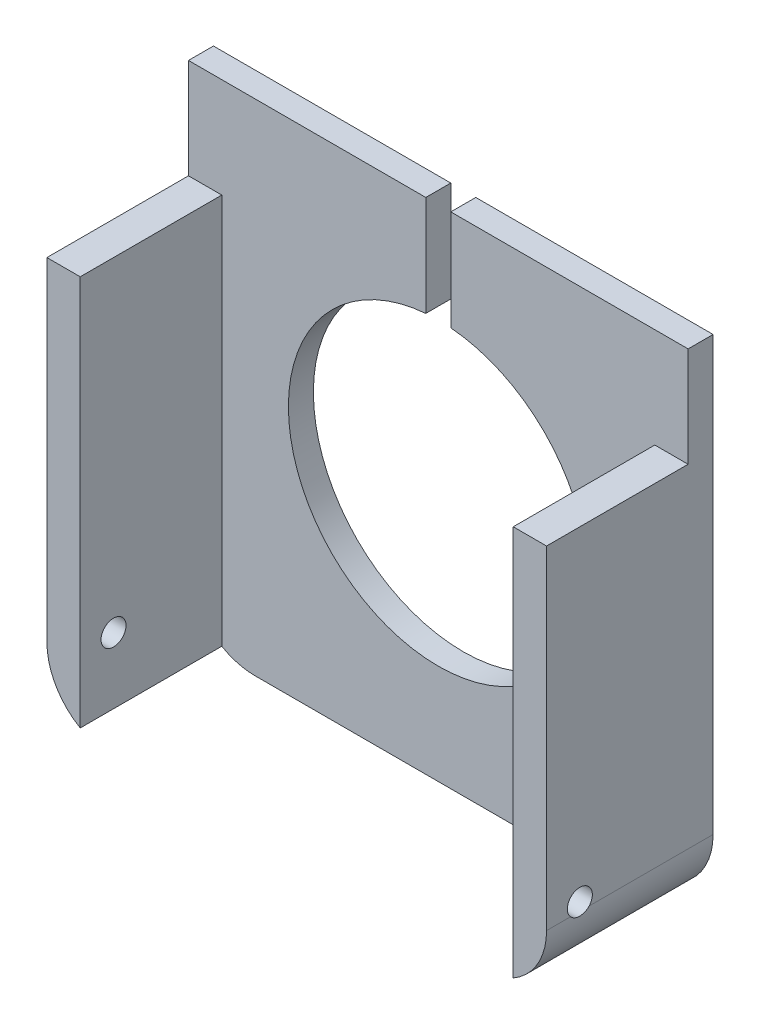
ISO-10303-21;
HEADER;
FILE_DESCRIPTION(('STEP AP214'),'2;1');
FILE_NAME('part.step','',(''),(''),'','','');
FILE_SCHEMA(('AUTOMOTIVE_DESIGN { 1 0 10303 214 1 1 1 1 }'));
ENDSEC;
DATA;
#1=APPLICATION_CONTEXT('core data for automotive mechanical design processes');
#2=APPLICATION_PROTOCOL_DEFINITION('international standard','automotive_design',2000,#1);
#3=PRODUCT_CONTEXT('',#1,'mechanical');
#4=PRODUCT('Part','Part','',(#3));
#5=PRODUCT_RELATED_PRODUCT_CATEGORY('part','',(#4));
#6=PRODUCT_DEFINITION_FORMATION('','',#4);
#7=PRODUCT_DEFINITION_CONTEXT('part definition',#1,'design');
#8=PRODUCT_DEFINITION('design','',#6,#7);
#9=PRODUCT_DEFINITION_SHAPE('','',#8);
#10=(LENGTH_UNIT() NAMED_UNIT(*) SI_UNIT(.MILLI.,.METRE.));
#11=(NAMED_UNIT(*) PLANE_ANGLE_UNIT() SI_UNIT($,.RADIAN.));
#12=(NAMED_UNIT(*) SI_UNIT($,.STERADIAN.) SOLID_ANGLE_UNIT());
#13=UNCERTAINTY_MEASURE_WITH_UNIT(LENGTH_MEASURE(1.E-05),#10,'distance_accuracy_value','');
#14=(GEOMETRIC_REPRESENTATION_CONTEXT(3) GLOBAL_UNCERTAINTY_ASSIGNED_CONTEXT((#13)) GLOBAL_UNIT_ASSIGNED_CONTEXT((#10,
#11,#12)) REPRESENTATION_CONTEXT('',''));
#15=CARTESIAN_POINT('',(0.,0.,0.));
#16=DIRECTION('',(0.,0.,1.));
#17=DIRECTION('',(1.,0.,0.));
#18=AXIS2_PLACEMENT_3D('',#15,#16,#17);
#19=CARTESIAN_POINT('',(-15.,15.,-10.));
#20=DIRECTION('',(0.,1.,0.));
#21=DIRECTION('',(0.,0.,1.));
#22=AXIS2_PLACEMENT_3D('',#19,#20,#21);
#23=PLANE('',#22);
#24=DIRECTION('',(0.,0.,1.));
#25=VECTOR('',#24,1.);
#26=CARTESIAN_POINT('',(-0.750000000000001,15.,-10.));
#27=LINE('',#26,#25);
#28=CARTESIAN_POINT('',(-0.75,15.,-10.));
#29=VERTEX_POINT('',#28);
#30=CARTESIAN_POINT('',(-0.75,15.,-8.5));
#31=VERTEX_POINT('',#30);
#32=EDGE_CURVE('E241',#29,#31,#27,.T.);
#33=ORIENTED_EDGE('',*,*,#32,.F.);
#34=DIRECTION('',(-1.,0.,0.));
#35=VECTOR('',#34,1.);
#36=CARTESIAN_POINT('',(-15.,15.,-10.));
#37=LINE('',#36,#35);
#38=CARTESIAN_POINT('',(-15.,15.,-10.));
#39=VERTEX_POINT('',#38);
#40=EDGE_CURVE('E281',#29,#39,#37,.T.);
#41=ORIENTED_EDGE('',*,*,#40,.T.);
#42=DIRECTION('',(0.,0.,1.));
#43=VECTOR('',#42,1.);
#44=CARTESIAN_POINT('',(-15.,15.,-10.));
#45=LINE('',#44,#43);
#46=CARTESIAN_POINT('',(-15.,15.,-8.5));
#47=VERTEX_POINT('',#46);
#48=EDGE_CURVE('E294',#39,#47,#45,.T.);
#49=ORIENTED_EDGE('',*,*,#48,.T.);
#50=DIRECTION('',(1.,0.,0.));
#51=VECTOR('',#50,1.);
#52=CARTESIAN_POINT('',(-15.,15.,-8.5));
#53=LINE('',#52,#51);
#54=EDGE_CURVE('E305',#47,#31,#53,.T.);
#55=ORIENTED_EDGE('',*,*,#54,.T.);
#56=EDGE_LOOP('',(#33,#41,#49,#55));
#57=FACE_BOUND('',#56,.T.);
#58=ADVANCED_FACE('F35',(#57),#23,.T.);
#59=DIRECTION('',(0.,0.,-1.));
#60=VECTOR('',#59,1.);
#61=CARTESIAN_POINT('',(0.750000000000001,15.,-10.));
#62=LINE('',#61,#60);
#63=CARTESIAN_POINT('',(0.75,15.,-8.5));
#64=VERTEX_POINT('',#63);
#65=CARTESIAN_POINT('',(0.75,15.,-10.));
#66=VERTEX_POINT('',#65);
#67=EDGE_CURVE('E232',#64,#66,#62,.T.);
#68=ORIENTED_EDGE('',*,*,#67,.F.);
#69=CARTESIAN_POINT('',(15.,15.,-8.5));
#70=VERTEX_POINT('',#69);
#71=EDGE_CURVE('E229',#64,#70,#53,.T.);
#72=ORIENTED_EDGE('',*,*,#71,.T.);
#73=DIRECTION('',(0.,0.,1.));
#74=VECTOR('',#73,1.);
#75=CARTESIAN_POINT('',(15.,15.,-10.));
#76=LINE('',#75,#74);
#77=CARTESIAN_POINT('',(15.,15.,-10.));
#78=VERTEX_POINT('',#77);
#79=EDGE_CURVE('E291',#78,#70,#76,.T.);
#80=ORIENTED_EDGE('',*,*,#79,.F.);
#81=EDGE_CURVE('E283',#78,#66,#37,.T.);
#82=ORIENTED_EDGE('',*,*,#81,.T.);
#83=EDGE_LOOP('',(#68,#72,#80,#82));
#84=FACE_BOUND('',#83,.T.);
#85=ADVANCED_FACE('F341',(#84),#23,.T.);
#86=CARTESIAN_POINT('',(0.,0.,0.));
#87=DIRECTION('',(0.,0.,-1.));
#88=DIRECTION('',(-1.,0.,0.));
#89=AXIS2_PLACEMENT_3D('',#86,#87,#88);
#90=PLANE('',#89);
#91=DIRECTION('',(0.,-1.,0.));
#92=VECTOR('',#91,1.);
#93=CARTESIAN_POINT('',(13.,0.,0.));
#94=LINE('',#93,#92);
#95=CARTESIAN_POINT('',(13.,8.99999999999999,0.));
#96=VERTEX_POINT('',#95);
#97=CARTESIAN_POINT('',(13.,-14.4641016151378,0.));
#98=VERTEX_POINT('',#97);
#99=EDGE_CURVE('E302',#96,#98,#94,.T.);
#100=ORIENTED_EDGE('',*,*,#99,.T.);
#101=CARTESIAN_POINT('',(11.,-11.,0.));
#102=DIRECTION('',(0.,0.,-1.));
#103=DIRECTION('',(-1.,0.,0.));
#104=AXIS2_PLACEMENT_3D('',#101,#102,#103);
#105=CIRCLE('',#104,4.);
#106=CARTESIAN_POINT('',(15.,-11.,0.));
#107=VERTEX_POINT('',#106);
#108=EDGE_CURVE('E318',#98,#107,#105,.F.);
#109=ORIENTED_EDGE('',*,*,#108,.T.);
#110=DIRECTION('',(0.,1.,0.));
#111=VECTOR('',#110,1.);
#112=CARTESIAN_POINT('',(15.,-15.,0.));
#113=LINE('',#112,#111);
#114=CARTESIAN_POINT('',(15.,8.99999999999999,0.));
#115=VERTEX_POINT('',#114);
#116=EDGE_CURVE('E278',#107,#115,#113,.T.);
#117=ORIENTED_EDGE('',*,*,#116,.T.);
#118=DIRECTION('',(1.,0.,0.));
#119=VECTOR('',#118,1.);
#120=CARTESIAN_POINT('',(13.,8.99999999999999,0.));
#121=LINE('',#120,#119);
#122=EDGE_CURVE('E247',#96,#115,#121,.T.);
#123=ORIENTED_EDGE('',*,*,#122,.F.);
#124=EDGE_LOOP('',(#100,#109,#117,#123));
#125=FACE_BOUND('',#124,.T.);
#126=ADVANCED_FACE('F339',(#125),#90,.F.);
#127=CARTESIAN_POINT('',(15.,-15.,-10.));
#128=DIRECTION('',(1.,0.,0.));
#129=DIRECTION('',(0.,0.,-1.));
#130=AXIS2_PLACEMENT_3D('',#127,#128,#129);
#131=PLANE('',#130);
#132=CARTESIAN_POINT('',(15.,-10.5,-2.));
#133=DIRECTION('',(1.,0.,0.));
#134=DIRECTION('',(0.,0.,-1.));
#135=AXIS2_PLACEMENT_3D('',#132,#133,#134);
#136=CIRCLE('',#135,0.75);
#137=CARTESIAN_POINT('',(15.,-11.,-2.55901699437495));
#138=VERTEX_POINT('',#137);
#139=CARTESIAN_POINT('',(15.,-11.,-1.44098300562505));
#140=VERTEX_POINT('',#139);
#141=EDGE_CURVE('E52',#138,#140,#136,.T.);
#142=ORIENTED_EDGE('',*,*,#141,.F.);
#143=DIRECTION('',(0.,0.,1.));
#144=VECTOR('',#143,1.);
#145=CARTESIAN_POINT('',(15.,-11.,-10.));
#146=LINE('',#145,#144);
#147=CARTESIAN_POINT('',(15.,-11.,-10.));
#148=VERTEX_POINT('',#147);
#149=EDGE_CURVE('E40',#138,#148,#146,.F.);
#150=ORIENTED_EDGE('',*,*,#149,.T.);
#151=DIRECTION('',(0.,1.,0.));
#152=VECTOR('',#151,1.);
#153=CARTESIAN_POINT('',(15.,-15.,-10.));
#154=LINE('',#153,#152);
#155=EDGE_CURVE('E279',#148,#78,#154,.T.);
#156=ORIENTED_EDGE('',*,*,#155,.T.);
#157=ORIENTED_EDGE('',*,*,#79,.T.);
#158=DIRECTION('',(0.,-1.,0.));
#159=VECTOR('',#158,1.);
#160=CARTESIAN_POINT('',(15.,-15.,-8.5));
#161=LINE('',#160,#159);
#162=CARTESIAN_POINT('',(15.,8.99999999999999,-8.5));
#163=VERTEX_POINT('',#162);
#164=EDGE_CURVE('E272',#70,#163,#161,.T.);
#165=ORIENTED_EDGE('',*,*,#164,.T.);
#166=DIRECTION('',(0.,0.,-1.));
#167=VECTOR('',#166,1.);
#168=CARTESIAN_POINT('',(15.,8.99999999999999,-10.));
#169=LINE('',#168,#167);
#170=EDGE_CURVE('E267',#115,#163,#169,.T.);
#171=ORIENTED_EDGE('',*,*,#170,.F.);
#172=ORIENTED_EDGE('',*,*,#116,.F.);
#173=EDGE_CURVE('E321',#107,#140,#146,.F.);
#174=ORIENTED_EDGE('',*,*,#173,.T.);
#175=EDGE_LOOP('',(#142,#150,#156,#157,#165,#171,#172,#174));
#176=FACE_BOUND('',#175,.T.);
#177=ADVANCED_FACE('F335',(#176),#131,.T.);
#178=CARTESIAN_POINT('',(-15.,-15.,-10.));
#179=DIRECTION('',(0.,-1.,0.));
#180=DIRECTION('',(0.,0.,-1.));
#181=AXIS2_PLACEMENT_3D('',#178,#179,#180);
#182=PLANE('',#181);
#183=DIRECTION('',(1.,0.,0.));
#184=VECTOR('',#183,1.);
#185=CARTESIAN_POINT('',(-15.,-15.,-10.));
#186=LINE('',#185,#184);
#187=CARTESIAN_POINT('',(-11.,-15.,-10.));
#188=VERTEX_POINT('',#187);
#189=CARTESIAN_POINT('',(11.,-15.,-10.));
#190=VERTEX_POINT('',#189);
#191=EDGE_CURVE('E288',#188,#190,#186,.T.);
#192=ORIENTED_EDGE('',*,*,#191,.T.);
#193=DIRECTION('',(0.,0.,1.));
#194=VECTOR('',#193,1.);
#195=CARTESIAN_POINT('',(11.,-15.,-10.));
#196=LINE('',#195,#194);
#197=CARTESIAN_POINT('',(11.,-15.,-8.5));
#198=VERTEX_POINT('',#197);
#199=EDGE_CURVE('E309',#190,#198,#196,.T.);
#200=ORIENTED_EDGE('',*,*,#199,.T.);
#201=DIRECTION('',(-1.,0.,0.));
#202=VECTOR('',#201,1.);
#203=CARTESIAN_POINT('',(-15.,-15.,-8.5));
#204=LINE('',#203,#202);
#205=CARTESIAN_POINT('',(-11.,-15.,-8.5));
#206=VERTEX_POINT('',#205);
#207=EDGE_CURVE('E275',#198,#206,#204,.T.);
#208=ORIENTED_EDGE('',*,*,#207,.T.);
#209=DIRECTION('',(0.,0.,1.));
#210=VECTOR('',#209,1.);
#211=CARTESIAN_POINT('',(-11.,-15.,-10.));
#212=LINE('',#211,#210);
#213=EDGE_CURVE('E307',#206,#188,#212,.F.);
#214=ORIENTED_EDGE('',*,*,#213,.T.);
#215=EDGE_LOOP('',(#192,#200,#208,#214));
#216=FACE_BOUND('',#215,.T.);
#217=ADVANCED_FACE('F338',(#216),#182,.T.);
#218=CARTESIAN_POINT('',(-15.,-15.,-10.));
#219=DIRECTION('',(-1.,0.,0.));
#220=DIRECTION('',(0.,0.,1.));
#221=AXIS2_PLACEMENT_3D('',#218,#219,#220);
#222=PLANE('',#221);
#223=CARTESIAN_POINT('',(-15.,-10.5,-2.));
#224=DIRECTION('',(1.,0.,0.));
#225=DIRECTION('',(0.,0.,-1.));
#226=AXIS2_PLACEMENT_3D('',#223,#224,#225);
#227=CIRCLE('',#226,0.75);
#228=CARTESIAN_POINT('',(-15.,-11.,-2.55901699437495));
#229=VERTEX_POINT('',#228);
#230=CARTESIAN_POINT('',(-15.,-11.,-1.44098300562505));
#231=VERTEX_POINT('',#230);
#232=EDGE_CURVE('E58',#229,#231,#227,.T.);
#233=ORIENTED_EDGE('',*,*,#232,.T.);
#234=DIRECTION('',(0.,0.,1.));
#235=VECTOR('',#234,1.);
#236=CARTESIAN_POINT('',(-15.,-11.,-10.));
#237=LINE('',#236,#235);
#238=CARTESIAN_POINT('',(-15.,-11.,0.));
#239=VERTEX_POINT('',#238);
#240=EDGE_CURVE('E172',#231,#239,#237,.T.);
#241=ORIENTED_EDGE('',*,*,#240,.T.);
#242=DIRECTION('',(0.,-1.,0.));
#243=VECTOR('',#242,1.);
#244=CARTESIAN_POINT('',(-15.,-15.,0.));
#245=LINE('',#244,#243);
#246=CARTESIAN_POINT('',(-15.,8.99999999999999,0.));
#247=VERTEX_POINT('',#246);
#248=EDGE_CURVE('E282',#247,#239,#245,.T.);
#249=ORIENTED_EDGE('',*,*,#248,.F.);
#250=DIRECTION('',(0.,0.,1.));
#251=VECTOR('',#250,1.);
#252=CARTESIAN_POINT('',(-15.,8.99999999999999,-10.));
#253=LINE('',#252,#251);
#254=CARTESIAN_POINT('',(-15.,8.99999999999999,-8.5));
#255=VERTEX_POINT('',#254);
#256=EDGE_CURVE('E263',#255,#247,#253,.T.);
#257=ORIENTED_EDGE('',*,*,#256,.F.);
#258=DIRECTION('',(0.,1.,0.));
#259=VECTOR('',#258,1.);
#260=CARTESIAN_POINT('',(-15.,-15.,-8.5));
#261=LINE('',#260,#259);
#262=EDGE_CURVE('E269',#255,#47,#261,.T.);
#263=ORIENTED_EDGE('',*,*,#262,.T.);
#264=ORIENTED_EDGE('',*,*,#48,.F.);
#265=DIRECTION('',(0.,-1.,0.));
#266=VECTOR('',#265,1.);
#267=CARTESIAN_POINT('',(-15.,-15.,-10.));
#268=LINE('',#267,#266);
#269=CARTESIAN_POINT('',(-15.,-11.,-10.));
#270=VERTEX_POINT('',#269);
#271=EDGE_CURVE('E286',#39,#270,#268,.T.);
#272=ORIENTED_EDGE('',*,*,#271,.T.);
#273=EDGE_CURVE('E175',#270,#229,#237,.T.);
#274=ORIENTED_EDGE('',*,*,#273,.T.);
#275=EDGE_LOOP('',(#233,#241,#249,#257,#263,#264,#272,#274));
#276=FACE_BOUND('',#275,.T.);
#277=ADVANCED_FACE('F170',(#276),#222,.T.);
#278=CARTESIAN_POINT('',(0.,0.,-10.));
#279=DIRECTION('',(0.,0.,-1.));
#280=DIRECTION('',(-1.,0.,0.));
#281=AXIS2_PLACEMENT_3D('',#278,#279,#280);
#282=PLANE('',#281);
#283=DIRECTION('',(0.,1.,0.));
#284=VECTOR('',#283,1.);
#285=CARTESIAN_POINT('',(-0.75,8.40326729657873,-10.));
#286=LINE('',#285,#284);
#287=CARTESIAN_POINT('',(-0.75,8.96869555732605,-10.));
#288=VERTEX_POINT('',#287);
#289=EDGE_CURVE('E233',#288,#29,#286,.T.);
#290=ORIENTED_EDGE('',*,*,#289,.F.);
#291=CARTESIAN_POINT('',(0.,0.,-10.));
#292=DIRECTION('',(0.,0.,-1.));
#293=DIRECTION('',(-1.,0.,0.));
#294=AXIS2_PLACEMENT_3D('',#291,#292,#293);
#295=CIRCLE('',#294,9.);
#296=CARTESIAN_POINT('',(0.749999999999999,8.96869555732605,-10.));
#297=VERTEX_POINT('',#296);
#298=EDGE_CURVE('E202',#297,#288,#295,.T.);
#299=ORIENTED_EDGE('',*,*,#298,.F.);
#300=DIRECTION('',(0.,-1.,0.));
#301=VECTOR('',#300,1.);
#302=CARTESIAN_POINT('',(0.75,15.4131357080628,-10.));
#303=LINE('',#302,#301);
#304=EDGE_CURVE('E236',#66,#297,#303,.T.);
#305=ORIENTED_EDGE('',*,*,#304,.F.);
#306=ORIENTED_EDGE('',*,*,#81,.F.);
#307=ORIENTED_EDGE('',*,*,#155,.F.);
#308=CARTESIAN_POINT('',(11.,-11.,-10.));
#309=DIRECTION('',(0.,0.,-1.));
#310=DIRECTION('',(-1.,0.,0.));
#311=AXIS2_PLACEMENT_3D('',#308,#309,#310);
#312=CIRCLE('',#311,4.);
#313=EDGE_CURVE('E181',#148,#190,#312,.T.);
#314=ORIENTED_EDGE('',*,*,#313,.T.);
#315=ORIENTED_EDGE('',*,*,#191,.F.);
#316=CARTESIAN_POINT('',(-11.,-11.,-10.));
#317=DIRECTION('',(0.,0.,-1.));
#318=DIRECTION('',(-1.,0.,0.));
#319=AXIS2_PLACEMENT_3D('',#316,#317,#318);
#320=CIRCLE('',#319,4.);
#321=EDGE_CURVE('E184',#188,#270,#320,.T.);
#322=ORIENTED_EDGE('',*,*,#321,.T.);
#323=ORIENTED_EDGE('',*,*,#271,.F.);
#324=ORIENTED_EDGE('',*,*,#40,.F.);
#325=EDGE_LOOP('',(#290,#299,#305,#306,#307,#314,#315,#322,#323,#324));
#326=FACE_BOUND('',#325,.T.);
#327=ADVANCED_FACE('F347',(#326),#282,.T.);
#328=ORIENTED_EDGE('',*,*,#248,.T.);
#329=CARTESIAN_POINT('',(-11.,-11.,0.));
#330=DIRECTION('',(0.,0.,-1.));
#331=DIRECTION('',(-1.,0.,0.));
#332=AXIS2_PLACEMENT_3D('',#329,#330,#331);
#333=CIRCLE('',#332,4.);
#334=CARTESIAN_POINT('',(-13.,-14.4641016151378,0.));
#335=VERTEX_POINT('',#334);
#336=EDGE_CURVE('E179',#239,#335,#333,.F.);
#337=ORIENTED_EDGE('',*,*,#336,.T.);
#338=DIRECTION('',(0.,-1.,0.));
#339=VECTOR('',#338,1.);
#340=CARTESIAN_POINT('',(-13.,8.99999999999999,0.));
#341=LINE('',#340,#339);
#342=CARTESIAN_POINT('',(-13.,8.99999999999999,0.));
#343=VERTEX_POINT('',#342);
#344=EDGE_CURVE('E201',#343,#335,#341,.T.);
#345=ORIENTED_EDGE('',*,*,#344,.F.);
#346=DIRECTION('',(-1.,0.,0.));
#347=VECTOR('',#346,1.);
#348=CARTESIAN_POINT('',(0.,8.99999999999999,0.));
#349=LINE('',#348,#347);
#350=EDGE_CURVE('E297',#343,#247,#349,.T.);
#351=ORIENTED_EDGE('',*,*,#350,.T.);
#352=EDGE_LOOP('',(#328,#337,#345,#351));
#353=FACE_BOUND('',#352,.T.);
#354=ADVANCED_FACE('F351',(#353),#90,.F.);
#355=CARTESIAN_POINT('',(13.,8.99999999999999,-8.5));
#356=DIRECTION('',(0.,-1.,0.));
#357=DIRECTION('',(0.,0.,-1.));
#358=AXIS2_PLACEMENT_3D('',#355,#356,#357);
#359=PLANE('',#358);
#360=ORIENTED_EDGE('',*,*,#170,.T.);
#361=DIRECTION('',(1.,0.,0.));
#362=VECTOR('',#361,1.);
#363=CARTESIAN_POINT('',(13.,8.99999999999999,-8.5));
#364=LINE('',#363,#362);
#365=CARTESIAN_POINT('',(13.,8.99999999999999,-8.5));
#366=VERTEX_POINT('',#365);
#367=EDGE_CURVE('E252',#366,#163,#364,.T.);
#368=ORIENTED_EDGE('',*,*,#367,.F.);
#369=DIRECTION('',(0.,0.,1.));
#370=VECTOR('',#369,1.);
#371=CARTESIAN_POINT('',(13.,8.99999999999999,-8.5));
#372=LINE('',#371,#370);
#373=EDGE_CURVE('E260',#366,#96,#372,.T.);
#374=ORIENTED_EDGE('',*,*,#373,.T.);
#375=ORIENTED_EDGE('',*,*,#122,.T.);
#376=EDGE_LOOP('',(#360,#368,#374,#375));
#377=FACE_BOUND('',#376,.T.);
#378=ADVANCED_FACE('F354',(#377),#359,.F.);
#379=CARTESIAN_POINT('',(13.,-16.2788669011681,-8.5));
#380=DIRECTION('',(1.,0.,0.));
#381=DIRECTION('',(0.,0.,-1.));
#382=AXIS2_PLACEMENT_3D('',#379,#380,#381);
#383=PLANE('',#382);
#384=CARTESIAN_POINT('',(13.,-10.5,-2.));
#385=DIRECTION('',(1.,0.,0.));
#386=DIRECTION('',(0.,0.,-1.));
#387=AXIS2_PLACEMENT_3D('',#384,#385,#386);
#388=CIRCLE('',#387,0.75);
#389=CARTESIAN_POINT('',(13.,-10.5,-2.75));
#390=VERTEX_POINT('',#389);
#391=EDGE_CURVE('E407',#390,#390,#388,.T.);
#392=ORIENTED_EDGE('',*,*,#391,.T.);
#393=EDGE_LOOP('',(#392));
#394=FACE_BOUND('',#393,.T.);
#395=DIRECTION('',(0.,1.,0.));
#396=VECTOR('',#395,1.);
#397=CARTESIAN_POINT('',(13.,-16.2788669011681,-8.5));
#398=LINE('',#397,#396);
#399=CARTESIAN_POINT('',(13.,-14.4641016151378,-8.5));
#400=VERTEX_POINT('',#399);
#401=EDGE_CURVE('E250',#400,#366,#398,.T.);
#402=ORIENTED_EDGE('',*,*,#401,.F.);
#403=DIRECTION('',(0.,0.,1.));
#404=VECTOR('',#403,1.);
#405=CARTESIAN_POINT('',(13.,-14.4641016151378,-8.5));
#406=LINE('',#405,#404);
#407=EDGE_CURVE('E316',#400,#98,#406,.T.);
#408=ORIENTED_EDGE('',*,*,#407,.T.);
#409=ORIENTED_EDGE('',*,*,#99,.F.);
#410=ORIENTED_EDGE('',*,*,#373,.F.);
#411=EDGE_LOOP('',(#402,#408,#409,#410));
#412=FACE_BOUND('',#411,.T.);
#413=ADVANCED_FACE('F366',(#394,#412),#383,.F.);
#414=CARTESIAN_POINT('',(-13.,8.99999999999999,-8.5));
#415=DIRECTION('',(-1.,0.,0.));
#416=DIRECTION('',(0.,-1.,0.));
#417=AXIS2_PLACEMENT_3D('',#414,#415,#416);
#418=PLANE('',#417);
#419=CARTESIAN_POINT('',(-13.,-10.5,-2.));
#420=DIRECTION('',(-1.,0.,0.));
#421=DIRECTION('',(0.,-1.,0.));
#422=AXIS2_PLACEMENT_3D('',#419,#420,#421);
#423=CIRCLE('',#422,0.75);
#424=CARTESIAN_POINT('',(-13.,-11.25,-2.));
#425=VERTEX_POINT('',#424);
#426=EDGE_CURVE('E405',#425,#425,#423,.T.);
#427=ORIENTED_EDGE('',*,*,#426,.T.);
#428=EDGE_LOOP('',(#427));
#429=FACE_BOUND('',#428,.T.);
#430=ORIENTED_EDGE('',*,*,#344,.T.);
#431=DIRECTION('',(0.,0.,1.));
#432=VECTOR('',#431,1.);
#433=CARTESIAN_POINT('',(-13.,-14.4641016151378,0.));
#434=LINE('',#433,#432);
#435=CARTESIAN_POINT('',(-13.,-14.4641016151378,-8.5));
#436=VERTEX_POINT('',#435);
#437=EDGE_CURVE('E195',#335,#436,#434,.F.);
#438=ORIENTED_EDGE('',*,*,#437,.T.);
#439=DIRECTION('',(0.,-1.,0.));
#440=VECTOR('',#439,1.);
#441=CARTESIAN_POINT('',(-13.,8.99999999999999,-8.5));
#442=LINE('',#441,#440);
#443=CARTESIAN_POINT('',(-13.,8.99999999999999,-8.5));
#444=VERTEX_POINT('',#443);
#445=EDGE_CURVE('E246',#444,#436,#442,.T.);
#446=ORIENTED_EDGE('',*,*,#445,.F.);
#447=DIRECTION('',(0.,0.,1.));
#448=VECTOR('',#447,1.);
#449=CARTESIAN_POINT('',(-13.,8.99999999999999,-8.5));
#450=LINE('',#449,#448);
#451=EDGE_CURVE('E255',#444,#343,#450,.T.);
#452=ORIENTED_EDGE('',*,*,#451,.T.);
#453=EDGE_LOOP('',(#430,#438,#446,#452));
#454=FACE_BOUND('',#453,.T.);
#455=ADVANCED_FACE('F362',(#429,#454),#418,.F.);
#456=CARTESIAN_POINT('',(-19.532174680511,8.99999999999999,-8.5));
#457=DIRECTION('',(0.,-1.,0.));
#458=DIRECTION('',(0.,0.,-1.));
#459=AXIS2_PLACEMENT_3D('',#456,#457,#458);
#460=PLANE('',#459);
#461=ORIENTED_EDGE('',*,*,#256,.T.);
#462=ORIENTED_EDGE('',*,*,#350,.F.);
#463=ORIENTED_EDGE('',*,*,#451,.F.);
#464=DIRECTION('',(1.,0.,0.));
#465=VECTOR('',#464,1.);
#466=CARTESIAN_POINT('',(-19.532174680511,8.99999999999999,-8.5));
#467=LINE('',#466,#465);
#468=EDGE_CURVE('E244',#255,#444,#467,.T.);
#469=ORIENTED_EDGE('',*,*,#468,.F.);
#470=EDGE_LOOP('',(#461,#462,#463,#469));
#471=FACE_BOUND('',#470,.T.);
#472=ADVANCED_FACE('F359',(#471),#460,.F.);
#473=CARTESIAN_POINT('',(0.,0.,-8.5));
#474=DIRECTION('',(0.,0.,1.));
#475=DIRECTION('',(1.,0.,0.));
#476=AXIS2_PLACEMENT_3D('',#473,#474,#475);
#477=PLANE('',#476);
#478=DIRECTION('',(0.,-1.,0.));
#479=VECTOR('',#478,1.);
#480=CARTESIAN_POINT('',(-0.75,0.,-8.5));
#481=LINE('',#480,#479);
#482=CARTESIAN_POINT('',(-0.75,8.96869555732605,-8.5));
#483=VERTEX_POINT('',#482);
#484=EDGE_CURVE('E224',#31,#483,#481,.T.);
#485=ORIENTED_EDGE('',*,*,#484,.F.);
#486=ORIENTED_EDGE('',*,*,#54,.F.);
#487=ORIENTED_EDGE('',*,*,#262,.F.);
#488=ORIENTED_EDGE('',*,*,#468,.T.);
#489=ORIENTED_EDGE('',*,*,#445,.T.);
#490=CARTESIAN_POINT('',(-11.,-11.,-8.5));
#491=DIRECTION('',(0.,0.,1.));
#492=DIRECTION('',(1.,0.,0.));
#493=AXIS2_PLACEMENT_3D('',#490,#491,#492);
#494=CIRCLE('',#493,4.);
#495=EDGE_CURVE('E312',#436,#206,#494,.T.);
#496=ORIENTED_EDGE('',*,*,#495,.T.);
#497=ORIENTED_EDGE('',*,*,#207,.F.);
#498=CARTESIAN_POINT('',(11.,-11.,-8.5));
#499=DIRECTION('',(0.,0.,1.));
#500=DIRECTION('',(1.,0.,0.));
#501=AXIS2_PLACEMENT_3D('',#498,#499,#500);
#502=CIRCLE('',#501,4.);
#503=EDGE_CURVE('E314',#198,#400,#502,.T.);
#504=ORIENTED_EDGE('',*,*,#503,.T.);
#505=ORIENTED_EDGE('',*,*,#401,.T.);
#506=ORIENTED_EDGE('',*,*,#367,.T.);
#507=ORIENTED_EDGE('',*,*,#164,.F.);
#508=ORIENTED_EDGE('',*,*,#71,.F.);
#509=DIRECTION('',(0.,1.,0.));
#510=VECTOR('',#509,1.);
#511=CARTESIAN_POINT('',(0.749999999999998,0.,-8.5));
#512=LINE('',#511,#510);
#513=CARTESIAN_POINT('',(0.749999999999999,8.96869555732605,-8.5));
#514=VERTEX_POINT('',#513);
#515=EDGE_CURVE('E227',#514,#64,#512,.T.);
#516=ORIENTED_EDGE('',*,*,#515,.F.);
#517=CARTESIAN_POINT('',(0.,0.,-8.5));
#518=DIRECTION('',(0.,0.,1.));
#519=DIRECTION('',(1.,0.,0.));
#520=AXIS2_PLACEMENT_3D('',#517,#518,#519);
#521=CIRCLE('',#520,9.);
#522=EDGE_CURVE('E198',#483,#514,#521,.T.);
#523=ORIENTED_EDGE('',*,*,#522,.F.);
#524=EDGE_LOOP('',(#485,#486,#487,#488,#489,#496,#497,#504,#505,#506,#507,#508,#516,#523));
#525=FACE_BOUND('',#524,.T.);
#526=ADVANCED_FACE('F223',(#525),#477,.T.);
#527=CARTESIAN_POINT('',(11.,-11.,-10.));
#528=DIRECTION('',(0.,0.,1.));
#529=DIRECTION('',(1.,0.,0.));
#530=AXIS2_PLACEMENT_3D('',#527,#528,#529);
#531=CYLINDRICAL_SURFACE('',#530,4.);
#532=CARTESIAN_POINT('',(15.,-11.,-1.44098300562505));
#533=CARTESIAN_POINT('',(15.000000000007,-11.0065300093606,-1.44682353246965));
#534=CARTESIAN_POINT('',(14.9999954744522,-11.0129575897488,-1.45277857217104));
#535=CARTESIAN_POINT('',(14.9999773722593,-11.0256002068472,-1.46491014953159));
#536=CARTESIAN_POINT('',(14.9999637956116,-11.0318152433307,-1.47108668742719));
#537=CARTESIAN_POINT('',(14.9999275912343,-11.0440250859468,-1.48365373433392));
#538=CARTESIAN_POINT('',(14.9999049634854,-11.0500198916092,-1.49004424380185));
#539=CARTESIAN_POINT('',(14.9998506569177,-11.0617819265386,-1.50303137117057));
#540=CARTESIAN_POINT('',(14.9998189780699,-11.0675491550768,-1.50962798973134));
#541=CARTESIAN_POINT('',(14.9997465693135,-11.0788489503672,-1.52301923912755));
#542=CARTESIAN_POINT('',(14.9997058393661,-11.0843815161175,-1.52981387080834));
#543=CARTESIAN_POINT('',(14.9996153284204,-11.0952051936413,-1.54359280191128));
#544=CARTESIAN_POINT('',(14.9995655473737,-11.1004963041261,-1.55057710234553));
#545=CARTESIAN_POINT('',(14.9994569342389,-11.1108305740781,-1.5647267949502));
#546=CARTESIAN_POINT('',(14.9993981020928,-11.1158737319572,-1.57189218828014));
#547=CARTESIAN_POINT('',(14.9992713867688,-11.1257059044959,-1.58639526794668));
#548=CARTESIAN_POINT('',(14.9992035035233,-11.1304949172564,-1.59373295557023));
#549=CARTESIAN_POINT('',(14.9990586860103,-11.1398129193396,-1.60857161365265));
#550=CARTESIAN_POINT('',(14.9989817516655,-11.1443419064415,-1.61607258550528));
#551=CARTESIAN_POINT('',(14.998818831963,-11.1531342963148,-1.63122860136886));
#552=CARTESIAN_POINT('',(14.9987328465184,-11.1573976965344,-1.63888364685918));
#553=CARTESIAN_POINT('',(14.9985518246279,-11.165653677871,-1.65433841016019));
#554=CARTESIAN_POINT('',(14.9984567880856,-11.1696462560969,-1.66213812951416));
#555=CARTESIAN_POINT('',(14.9982576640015,-11.1773556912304,-1.67787266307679));
#556=CARTESIAN_POINT('',(14.9981535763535,-11.1810725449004,-1.68580747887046));
#557=CARTESIAN_POINT('',(14.9979363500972,-11.1882259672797,-1.70180246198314));
#558=CARTESIAN_POINT('',(14.997823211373,-11.1916625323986,-1.70986263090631));
#559=CARTESIAN_POINT('',(14.9975878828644,-11.1982511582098,-1.72609842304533));
#560=CARTESIAN_POINT('',(14.9974656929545,-11.2014032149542,-1.73427404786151));
#561=CARTESIAN_POINT('',(14.9972122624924,-11.2074189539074,-1.75073071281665));
#562=CARTESIAN_POINT('',(14.9970810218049,-11.2102826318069,-1.75901175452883));
#563=CARTESIAN_POINT('',(14.9968094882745,-11.2157180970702,-1.77566908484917));
#564=CARTESIAN_POINT('',(14.9966691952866,-11.2182898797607,-1.78404537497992));
#565=CARTESIAN_POINT('',(14.9963795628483,-11.2231383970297,-1.8008829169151));
#566=CARTESIAN_POINT('',(14.9962302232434,-11.2254151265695,-1.80934417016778));
#567=CARTESIAN_POINT('',(14.9959224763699,-11.2296707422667,-1.82634124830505));
#568=CARTESIAN_POINT('',(14.9957640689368,-11.23164962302,-1.83487707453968));
#569=CARTESIAN_POINT('',(14.9954382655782,-11.2353071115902,-1.85201281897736));
#570=CARTESIAN_POINT('',(14.9952708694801,-11.2369857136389,-1.86061273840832));
#571=CARTESIAN_POINT('',(14.9949267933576,-11.2400405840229,-1.87786610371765));
#572=CARTESIAN_POINT('',(14.994750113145,-11.2414168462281,-1.88651955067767));
#573=CARTESIAN_POINT('',(14.9943885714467,-11.2438653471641,-1.90386936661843));
#574=CARTESIAN_POINT('',(14.9942037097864,-11.2449375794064,-1.91256573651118));
#575=CARTESIAN_POINT('',(14.9938216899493,-11.2467767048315,-1.92999064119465));
#576=CARTESIAN_POINT('',(14.9936245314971,-11.2475435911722,-1.9387191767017));
#577=CARTESIAN_POINT('',(14.993233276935,-11.248771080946,-1.95619798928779));
#578=CARTESIAN_POINT('',(14.9930391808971,-11.2492316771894,-1.96494826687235));
#579=CARTESIAN_POINT('',(14.9925967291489,-11.2498460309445,-1.98245872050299));
#580=CARTESIAN_POINT('',(14.9923483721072,-11.2499997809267,-1.99121889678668));
#581=CARTESIAN_POINT('',(14.9920260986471,-11.2500001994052,-2.00797488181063));
#582=CARTESIAN_POINT('',(14.9919388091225,-11.2498725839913,-2.01597043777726));
#583=CARTESIAN_POINT('',(14.9918447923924,-11.2492400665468,-2.03575698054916));
#584=CARTESIAN_POINT('',(14.9918961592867,-11.2485845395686,-2.04754372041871));
#585=CARTESIAN_POINT('',(14.9920161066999,-11.2470719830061,-2.06661207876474));
#586=CARTESIAN_POINT('',(14.9920707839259,-11.2463854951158,-2.07390800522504));
#587=CARTESIAN_POINT('',(14.9922085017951,-11.2446959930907,-2.08942263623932));
#588=CARTESIAN_POINT('',(14.9922943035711,-11.2436634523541,-2.09763814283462));
#589=CARTESIAN_POINT('',(14.9924920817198,-11.2411926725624,-2.11497228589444));
#590=CARTESIAN_POINT('',(14.9926059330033,-11.2397214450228,-2.12408619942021));
#591=CARTESIAN_POINT('',(14.9928611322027,-11.2362746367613,-2.14318982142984));
#592=CARTESIAN_POINT('',(14.9930041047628,-11.2342626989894,-2.15317296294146));
#593=CARTESIAN_POINT('',(14.9933175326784,-11.2296271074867,-2.17397767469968));
#594=CARTESIAN_POINT('',(14.9934893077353,-11.2269638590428,-2.18479041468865));
#595=CARTESIAN_POINT('',(14.9938608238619,-11.2209105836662,-2.20720512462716));
#596=CARTESIAN_POINT('',(14.9940617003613,-11.217477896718,-2.21879557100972));
#597=CARTESIAN_POINT('',(14.9944908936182,-11.2097643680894,-2.24270244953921));
#598=CARTESIAN_POINT('',(14.994720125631,-11.2054380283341,-2.25500419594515));
#599=CARTESIAN_POINT('',(14.9952090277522,-11.1958110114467,-2.2802546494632));
#600=CARTESIAN_POINT('',(14.9954696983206,-11.1904622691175,-2.29318505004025));
#601=CARTESIAN_POINT('',(14.995959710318,-11.1797563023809,-2.31714605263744));
#602=CARTESIAN_POINT('',(14.9961889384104,-11.1744819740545,-2.3282138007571));
#603=CARTESIAN_POINT('',(14.9966249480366,-11.1636840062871,-2.34951196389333));
#604=CARTESIAN_POINT('',(14.99683227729,-11.1581873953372,-2.3597560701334));
#605=CARTESIAN_POINT('',(14.9972272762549,-11.1470368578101,-2.37942594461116));
#606=CARTESIAN_POINT('',(14.9974154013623,-11.1414078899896,-2.38886586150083));
#607=CARTESIAN_POINT('',(14.9977712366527,-11.1300773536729,-2.40695175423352));
#608=CARTESIAN_POINT('',(14.9979394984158,-11.1243987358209,-2.41561210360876));
#609=CARTESIAN_POINT('',(14.9982557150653,-11.1130465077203,-2.43216715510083));
#610=CARTESIAN_POINT('',(14.9984042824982,-11.1073939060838,-2.44007625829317));
#611=CARTESIAN_POINT('',(14.9986809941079,-11.0961643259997,-2.45516001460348));
#612=CARTESIAN_POINT('',(14.9988098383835,-11.0906064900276,-2.46234891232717));
#613=CARTESIAN_POINT('',(14.9990470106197,-11.0796302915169,-2.47602536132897));
#614=CARTESIAN_POINT('',(14.9991561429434,-11.074229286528,-2.48252683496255));
#615=CARTESIAN_POINT('',(14.9993538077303,-11.0636241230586,-2.49486255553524));
#616=CARTESIAN_POINT('',(14.9994432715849,-11.058435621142,-2.5007102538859));
#617=CARTESIAN_POINT('',(14.9996013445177,-11.0483066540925,-2.51177280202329));
#618=CARTESIAN_POINT('',(14.9996710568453,-11.0433802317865,-2.517000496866));
#619=CARTESIAN_POINT('',(14.9997898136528,-11.0338208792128,-2.52685685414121));
#620=CARTESIAN_POINT('',(14.9998401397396,-11.0292004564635,-2.53149764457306));
#621=CARTESIAN_POINT('',(14.9999519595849,-11.0165196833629,-2.54390505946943));
#622=CARTESIAN_POINT('',(14.9999960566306,-11.0083438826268,-2.55155410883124));
#623=CARTESIAN_POINT('',(15.,-11.,-2.55901699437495));
#624=B_SPLINE_CURVE_WITH_KNOTS('',3,(#532,#533,#534,#535,#536,#537,#538,#539,#540,#541,#542,
#543,#544,#545,#546,#547,#548,#549,#550,#551,#552,#553,#554,#555,#556,#557,#558,#559,#560,#561,
#562,#563,#564,#565,#566,#567,#568,#569,#570,#571,#572,#573,#574,#575,#576,#577,#578,#579,#580,
#581,#582,#583,#584,#585,#586,#587,#588,#589,#590,#591,#592,#593,#594,#595,#596,#597,#598,#599,
#600,#601,#602,#603,#604,#605,#606,#607,#608,#609,#610,#611,#612,#613,#614,#615,#616,#617,#618,
#619,#620,#621,#622,#623),.UNSPECIFIED.,.F.,.F.,(4,2,2,2,2,2,2,2,2,2,2,2,2,2,2,2,2,2,2,2,2,2,2,
2,2,2,2,2,2,2,2,2,2,2,2,2,2,2,2,2,2,2,2,2,2,4),(0.,0.026281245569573,0.05256251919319,
0.0788438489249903,0.105125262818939,0.131406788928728,0.15768845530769,0.183970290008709,
0.210252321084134,0.236534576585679,0.262817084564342,0.289099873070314,0.315382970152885,
0.341666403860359,0.367950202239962,0.394234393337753,0.420519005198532,0.446804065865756,
0.473089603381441,0.49937564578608,0.525662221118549,0.551949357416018,0.578237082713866,
0.604525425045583,0.630814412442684,0.654800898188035,0.69020036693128,0.712182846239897,
0.737019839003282,0.764711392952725,0.79525750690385,0.828658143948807,0.864913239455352,
0.904022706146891,0.945986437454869,0.982759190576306,1.01762887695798,1.05059545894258,
1.08165890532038,1.1108191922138,1.13807630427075,1.16343023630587,1.18688099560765,
1.20842860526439,1.22807310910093,1.26165099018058),.UNSPECIFIED.);
#625=EDGE_CURVE('E176',#140,#138,#624,.T.);
#626=ORIENTED_EDGE('',*,*,#625,.F.);
#627=ORIENTED_EDGE('',*,*,#173,.F.);
#628=ORIENTED_EDGE('',*,*,#108,.F.);
#629=ORIENTED_EDGE('',*,*,#407,.F.);
#630=ORIENTED_EDGE('',*,*,#503,.F.);
#631=ORIENTED_EDGE('',*,*,#199,.F.);
#632=ORIENTED_EDGE('',*,*,#313,.F.);
#633=ORIENTED_EDGE('',*,*,#149,.F.);
#634=EDGE_LOOP('',(#626,#627,#628,#629,#630,#631,#632,#633));
#635=FACE_BOUND('',#634,.T.);
#636=ADVANCED_FACE('F325',(#635),#531,.T.);
#637=CARTESIAN_POINT('',(-11.,-11.,-10.));
#638=DIRECTION('',(0.,0.,1.));
#639=DIRECTION('',(1.,0.,0.));
#640=AXIS2_PLACEMENT_3D('',#637,#638,#639);
#641=CYLINDRICAL_SURFACE('',#640,4.);
#642=CARTESIAN_POINT('',(-15.,-11.,-2.55901699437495));
#643=CARTESIAN_POINT('',(-15.0000000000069,-11.0065300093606,-2.55317646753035));
#644=CARTESIAN_POINT('',(-14.9999954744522,-11.0129575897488,-2.54722142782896));
#645=CARTESIAN_POINT('',(-14.9999773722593,-11.0256002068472,-2.53508985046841));
#646=CARTESIAN_POINT('',(-14.9999637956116,-11.0318152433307,-2.52891331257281));
#647=CARTESIAN_POINT('',(-14.9999275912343,-11.0440250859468,-2.51634626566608));
#648=CARTESIAN_POINT('',(-14.9999049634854,-11.0500198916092,-2.50995575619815));
#649=CARTESIAN_POINT('',(-14.9998506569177,-11.0617819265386,-2.49696862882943));
#650=CARTESIAN_POINT('',(-14.9998189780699,-11.0675491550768,-2.49037201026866));
#651=CARTESIAN_POINT('',(-14.9997465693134,-11.0788489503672,-2.47698076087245));
#652=CARTESIAN_POINT('',(-14.9997058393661,-11.0843815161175,-2.47018612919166));
#653=CARTESIAN_POINT('',(-14.9996153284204,-11.0952051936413,-2.45640719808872));
#654=CARTESIAN_POINT('',(-14.9995655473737,-11.1004963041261,-2.44942289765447));
#655=CARTESIAN_POINT('',(-14.9994569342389,-11.1108305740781,-2.4352732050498));
#656=CARTESIAN_POINT('',(-14.9993981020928,-11.1158737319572,-2.42810781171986));
#657=CARTESIAN_POINT('',(-14.9992713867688,-11.1257059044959,-2.41360473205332));
#658=CARTESIAN_POINT('',(-14.9992035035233,-11.1304949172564,-2.40626704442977));
#659=CARTESIAN_POINT('',(-14.9990586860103,-11.1398129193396,-2.39142838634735));
#660=CARTESIAN_POINT('',(-14.9989817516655,-11.1443419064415,-2.38392741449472));
#661=CARTESIAN_POINT('',(-14.998818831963,-11.1531342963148,-2.36877139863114));
#662=CARTESIAN_POINT('',(-14.9987328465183,-11.1573976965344,-2.36111635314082));
#663=CARTESIAN_POINT('',(-14.9985518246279,-11.165653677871,-2.34566158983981));
#664=CARTESIAN_POINT('',(-14.9984567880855,-11.1696462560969,-2.33786187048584));
#665=CARTESIAN_POINT('',(-14.9982576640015,-11.1773556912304,-2.32212733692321));
#666=CARTESIAN_POINT('',(-14.9981535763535,-11.1810725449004,-2.31419252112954));
#667=CARTESIAN_POINT('',(-14.9979363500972,-11.1882259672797,-2.29819753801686));
#668=CARTESIAN_POINT('',(-14.9978232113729,-11.1916625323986,-2.29013736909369));
#669=CARTESIAN_POINT('',(-14.9975878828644,-11.1982511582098,-2.27390157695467));
#670=CARTESIAN_POINT('',(-14.9974656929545,-11.2014032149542,-2.26572595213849));
#671=CARTESIAN_POINT('',(-14.9972122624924,-11.2074189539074,-2.24926928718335));
#672=CARTESIAN_POINT('',(-14.9970810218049,-11.2102826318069,-2.24098824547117));
#673=CARTESIAN_POINT('',(-14.9968094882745,-11.2157180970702,-2.22433091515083));
#674=CARTESIAN_POINT('',(-14.9966691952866,-11.2182898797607,-2.21595462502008));
#675=CARTESIAN_POINT('',(-14.9963795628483,-11.2231383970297,-2.1991170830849));
#676=CARTESIAN_POINT('',(-14.9962302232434,-11.2254151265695,-2.19065582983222));
#677=CARTESIAN_POINT('',(-14.9959224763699,-11.2296707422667,-2.17365875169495));
#678=CARTESIAN_POINT('',(-14.9957640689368,-11.23164962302,-2.16512292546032));
#679=CARTESIAN_POINT('',(-14.9954382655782,-11.2353071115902,-2.14798718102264));
#680=CARTESIAN_POINT('',(-14.9952708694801,-11.2369857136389,-2.13938726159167));
#681=CARTESIAN_POINT('',(-14.9949267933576,-11.2400405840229,-2.12213389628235));
#682=CARTESIAN_POINT('',(-14.994750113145,-11.2414168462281,-2.11348044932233));
#683=CARTESIAN_POINT('',(-14.9943885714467,-11.2438653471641,-2.09613063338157));
#684=CARTESIAN_POINT('',(-14.9942037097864,-11.2449375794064,-2.08743426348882));
#685=CARTESIAN_POINT('',(-14.9938216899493,-11.2467767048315,-2.07000935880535));
#686=CARTESIAN_POINT('',(-14.993624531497,-11.2475435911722,-2.0612808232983));
#687=CARTESIAN_POINT('',(-14.9932332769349,-11.248771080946,-2.04380201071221));
#688=CARTESIAN_POINT('',(-14.9930391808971,-11.2492316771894,-2.03505173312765));
#689=CARTESIAN_POINT('',(-14.9925967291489,-11.2498460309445,-2.01754127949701));
#690=CARTESIAN_POINT('',(-14.9923483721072,-11.2499997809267,-2.00878110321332));
#691=CARTESIAN_POINT('',(-14.9920260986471,-11.2500001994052,-1.99202511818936));
#692=CARTESIAN_POINT('',(-14.9919388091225,-11.2498725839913,-1.98402956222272));
#693=CARTESIAN_POINT('',(-14.9918447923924,-11.2492400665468,-1.96424301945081));
#694=CARTESIAN_POINT('',(-14.9918961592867,-11.2485845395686,-1.95245627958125));
#695=CARTESIAN_POINT('',(-14.9920161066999,-11.2470719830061,-1.93338792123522));
#696=CARTESIAN_POINT('',(-14.9920707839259,-11.2463854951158,-1.92609199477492));
#697=CARTESIAN_POINT('',(-14.9922085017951,-11.2446959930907,-1.91057736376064));
#698=CARTESIAN_POINT('',(-14.992294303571,-11.2436634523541,-1.90236185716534));
#699=CARTESIAN_POINT('',(-14.9924920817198,-11.2411926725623,-1.88502771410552));
#700=CARTESIAN_POINT('',(-14.9926059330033,-11.2397214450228,-1.87591380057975));
#701=CARTESIAN_POINT('',(-14.9928611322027,-11.2362746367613,-1.85681017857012));
#702=CARTESIAN_POINT('',(-14.9930041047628,-11.2342626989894,-1.8468270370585));
#703=CARTESIAN_POINT('',(-14.9933175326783,-11.2296271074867,-1.82602232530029));
#704=CARTESIAN_POINT('',(-14.9934893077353,-11.2269638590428,-1.81520958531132));
#705=CARTESIAN_POINT('',(-14.9938608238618,-11.2209105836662,-1.79279487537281));
#706=CARTESIAN_POINT('',(-14.9940617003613,-11.217477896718,-1.78120442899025));
#707=CARTESIAN_POINT('',(-14.9944908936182,-11.2097643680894,-1.75729755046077));
#708=CARTESIAN_POINT('',(-14.994720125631,-11.2054380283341,-1.74499580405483));
#709=CARTESIAN_POINT('',(-14.9952090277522,-11.1958110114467,-1.7197453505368));
#710=CARTESIAN_POINT('',(-14.9954696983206,-11.1904622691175,-1.70681494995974));
#711=CARTESIAN_POINT('',(-14.995959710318,-11.1797563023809,-1.68285394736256));
#712=CARTESIAN_POINT('',(-14.9961889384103,-11.1744819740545,-1.67178619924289));
#713=CARTESIAN_POINT('',(-14.9966249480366,-11.1636840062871,-1.65048803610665));
#714=CARTESIAN_POINT('',(-14.99683227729,-11.1581873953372,-1.64024392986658));
#715=CARTESIAN_POINT('',(-14.9972272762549,-11.1470368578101,-1.62057405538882));
#716=CARTESIAN_POINT('',(-14.9974154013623,-11.1414078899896,-1.61113413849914));
#717=CARTESIAN_POINT('',(-14.9977712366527,-11.1300773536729,-1.59304824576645));
#718=CARTESIAN_POINT('',(-14.9979394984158,-11.1243987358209,-1.58438789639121));
#719=CARTESIAN_POINT('',(-14.9982557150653,-11.1130465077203,-1.56783284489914));
#720=CARTESIAN_POINT('',(-14.9984042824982,-11.1073939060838,-1.55992374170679));
#721=CARTESIAN_POINT('',(-14.9986809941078,-11.0961643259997,-1.54483998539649));
#722=CARTESIAN_POINT('',(-14.9988098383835,-11.0906064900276,-1.53765108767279));
#723=CARTESIAN_POINT('',(-14.9990470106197,-11.0796302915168,-1.52397463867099));
#724=CARTESIAN_POINT('',(-14.9991561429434,-11.074229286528,-1.51747316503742));
#725=CARTESIAN_POINT('',(-14.9993538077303,-11.0636241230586,-1.50513744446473));
#726=CARTESIAN_POINT('',(-14.9994432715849,-11.0584356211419,-1.49928974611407));
#727=CARTESIAN_POINT('',(-14.9996013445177,-11.0483066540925,-1.48822719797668));
#728=CARTESIAN_POINT('',(-14.9996710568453,-11.0433802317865,-1.48299950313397));
#729=CARTESIAN_POINT('',(-14.9997898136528,-11.0338208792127,-1.47314314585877));
#730=CARTESIAN_POINT('',(-14.9998401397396,-11.0292004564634,-1.46850235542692));
#731=CARTESIAN_POINT('',(-14.9999519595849,-11.0165196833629,-1.45609494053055));
#732=CARTESIAN_POINT('',(-14.9999960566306,-11.0083438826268,-1.44844589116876));
#733=CARTESIAN_POINT('',(-15.,-11.,-1.44098300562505));
#734=B_SPLINE_CURVE_WITH_KNOTS('',3,(#642,#643,#644,#645,#646,#647,#648,#649,#650,#651,#652,
#653,#654,#655,#656,#657,#658,#659,#660,#661,#662,#663,#664,#665,#666,#667,#668,#669,#670,#671,
#672,#673,#674,#675,#676,#677,#678,#679,#680,#681,#682,#683,#684,#685,#686,#687,#688,#689,#690,
#691,#692,#693,#694,#695,#696,#697,#698,#699,#700,#701,#702,#703,#704,#705,#706,#707,#708,#709,
#710,#711,#712,#713,#714,#715,#716,#717,#718,#719,#720,#721,#722,#723,#724,#725,#726,#727,#728,
#729,#730,#731,#732,#733),.UNSPECIFIED.,.F.,.F.,(4,2,2,2,2,2,2,2,2,2,2,2,2,2,2,2,2,2,2,2,2,2,2,
2,2,2,2,2,2,2,2,2,2,2,2,2,2,2,2,2,2,2,2,2,2,4),(0.,0.0262812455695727,0.0525625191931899,
0.0788438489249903,0.105125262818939,0.131406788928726,0.157688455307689,0.18397029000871,
0.210252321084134,0.236534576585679,0.262817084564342,0.289099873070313,0.315382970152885,
0.341666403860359,0.367950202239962,0.394234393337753,0.420519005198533,0.446804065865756,
0.473089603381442,0.499375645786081,0.525662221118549,0.551949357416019,0.578237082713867,
0.604525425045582,0.630814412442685,0.654800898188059,0.690200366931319,0.71218284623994,
0.737019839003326,0.764711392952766,0.795257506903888,0.82865814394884,0.864913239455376,
0.904022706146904,0.945986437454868,0.98275919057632,1.017628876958,1.05059545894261,
1.08165890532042,1.11081919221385,1.1380763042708,1.16343023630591,1.18688099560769,
1.20842860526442,1.22807310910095,1.26165099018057),.UNSPECIFIED.);
#735=EDGE_CURVE('E11',#229,#231,#734,.T.);
#736=ORIENTED_EDGE('',*,*,#735,.F.);
#737=ORIENTED_EDGE('',*,*,#273,.F.);
#738=ORIENTED_EDGE('',*,*,#321,.F.);
#739=ORIENTED_EDGE('',*,*,#213,.F.);
#740=ORIENTED_EDGE('',*,*,#495,.F.);
#741=ORIENTED_EDGE('',*,*,#437,.F.);
#742=ORIENTED_EDGE('',*,*,#336,.F.);
#743=ORIENTED_EDGE('',*,*,#240,.F.);
#744=EDGE_LOOP('',(#736,#737,#738,#739,#740,#741,#742,#743));
#745=FACE_BOUND('',#744,.T.);
#746=ADVANCED_FACE('F37',(#745),#641,.T.);
#747=CARTESIAN_POINT('',(0.,0.,0.));
#748=DIRECTION('',(0.,0.,-1.));
#749=DIRECTION('',(-1.,0.,0.));
#750=AXIS2_PLACEMENT_3D('',#747,#748,#749);
#751=CYLINDRICAL_SURFACE('',#750,9.);
#752=ORIENTED_EDGE('',*,*,#298,.T.);
#753=DIRECTION('',(0.,0.,-1.));
#754=VECTOR('',#753,1.);
#755=CARTESIAN_POINT('',(-0.75,8.96869555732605,0.));
#756=LINE('',#755,#754);
#757=EDGE_CURVE('E46',#288,#483,#756,.F.);
#758=ORIENTED_EDGE('',*,*,#757,.T.);
#759=ORIENTED_EDGE('',*,*,#522,.T.);
#760=DIRECTION('',(0.,0.,-1.));
#761=VECTOR('',#760,1.);
#762=CARTESIAN_POINT('',(0.749999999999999,8.96869555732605,0.));
#763=LINE('',#762,#761);
#764=EDGE_CURVE('E197',#514,#297,#763,.T.);
#765=ORIENTED_EDGE('',*,*,#764,.T.);
#766=EDGE_LOOP('',(#752,#758,#759,#765));
#767=FACE_BOUND('',#766,.T.);
#768=ADVANCED_FACE('F216',(#767),#751,.F.);
#769=CARTESIAN_POINT('',(0.75,15.4131357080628,0.));
#770=DIRECTION('',(1.,0.,0.));
#771=DIRECTION('',(0.,1.,0.));
#772=AXIS2_PLACEMENT_3D('',#769,#770,#771);
#773=PLANE('',#772);
#774=ORIENTED_EDGE('',*,*,#67,.T.);
#775=ORIENTED_EDGE('',*,*,#304,.T.);
#776=ORIENTED_EDGE('',*,*,#764,.F.);
#777=ORIENTED_EDGE('',*,*,#515,.T.);
#778=EDGE_LOOP('',(#774,#775,#776,#777));
#779=FACE_BOUND('',#778,.T.);
#780=ADVANCED_FACE('F378',(#779),#773,.F.);
#781=CARTESIAN_POINT('',(-0.75,8.40326729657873,0.));
#782=DIRECTION('',(-1.,0.,0.));
#783=DIRECTION('',(0.,0.,1.));
#784=AXIS2_PLACEMENT_3D('',#781,#782,#783);
#785=PLANE('',#784);
#786=ORIENTED_EDGE('',*,*,#32,.T.);
#787=ORIENTED_EDGE('',*,*,#484,.T.);
#788=ORIENTED_EDGE('',*,*,#757,.F.);
#789=ORIENTED_EDGE('',*,*,#289,.T.);
#790=EDGE_LOOP('',(#786,#787,#788,#789));
#791=FACE_BOUND('',#790,.T.);
#792=ADVANCED_FACE('F381',(#791),#785,.F.);
#793=CARTESIAN_POINT('',(-15.,-10.5,-2.));
#794=DIRECTION('',(1.,0.,0.));
#795=DIRECTION('',(0.,0.,-1.));
#796=AXIS2_PLACEMENT_3D('',#793,#794,#795);
#797=CYLINDRICAL_SURFACE('',#796,0.75);
#798=ORIENTED_EDGE('',*,*,#735,.T.);
#799=ORIENTED_EDGE('',*,*,#232,.F.);
#800=EDGE_LOOP('',(#798,#799));
#801=FACE_BOUND('',#800,.T.);
#802=ORIENTED_EDGE('',*,*,#426,.F.);
#803=EDGE_LOOP('',(#802));
#804=FACE_BOUND('',#803,.T.);
#805=ADVANCED_FACE('F160',(#801,#804),#797,.F.);
#806=ORIENTED_EDGE('',*,*,#625,.T.);
#807=ORIENTED_EDGE('',*,*,#141,.T.);
#808=EDGE_LOOP('',(#806,#807));
#809=FACE_BOUND('',#808,.T.);
#810=ORIENTED_EDGE('',*,*,#391,.F.);
#811=EDGE_LOOP('',(#810));
#812=FACE_BOUND('',#811,.T.);
#813=ADVANCED_FACE('F384',(#809,#812),#797,.F.);
#814=CLOSED_SHELL('',(#58,#85,#126,#177,#217,#277,#327,#354,#378,#413,#455,#472,#526,#636,#746,
#768,#780,#792,#805,#813));
#815=MANIFOLD_SOLID_BREP('B2',#814);
#816=ADVANCED_BREP_SHAPE_REPRESENTATION('',(#18,#815),#14);
#817=SHAPE_DEFINITION_REPRESENTATION(#9,#816);
ENDSEC;
END-ISO-10303-21;
